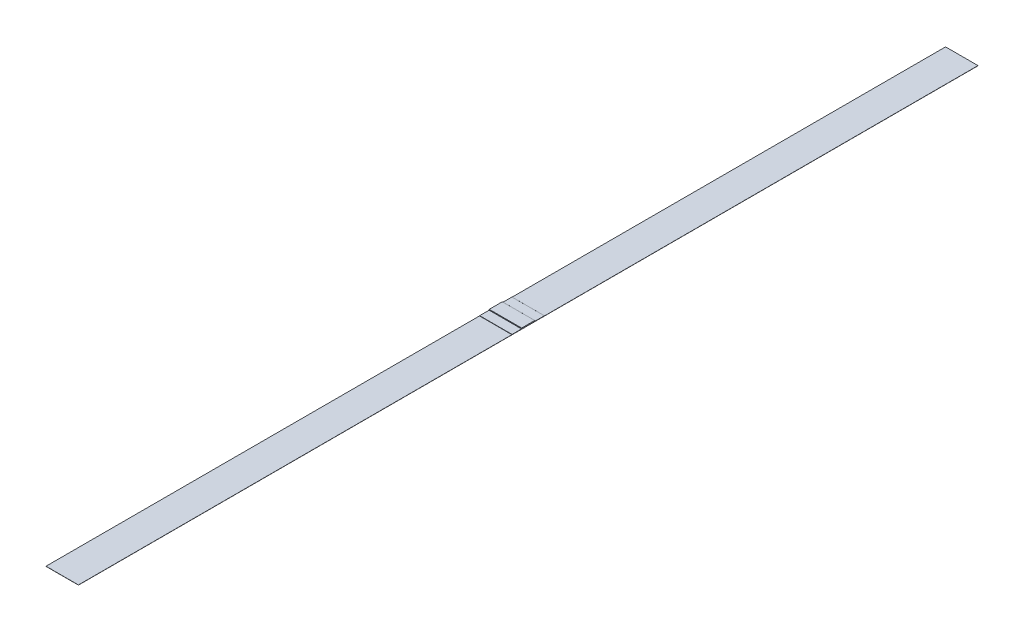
ISO-10303-21;
HEADER;
FILE_DESCRIPTION(('STEP AP214'),'2;1');
FILE_NAME('part.step','',(''),(''),'','','');
FILE_SCHEMA(('AUTOMOTIVE_DESIGN { 1 0 10303 214 1 1 1 1 }'));
ENDSEC;
DATA;
#1=APPLICATION_CONTEXT('core data for automotive mechanical design processes');
#2=APPLICATION_PROTOCOL_DEFINITION('international standard','automotive_design',2000,#1);
#3=PRODUCT_CONTEXT('',#1,'mechanical');
#4=PRODUCT('Part','Part','',(#3));
#5=PRODUCT_RELATED_PRODUCT_CATEGORY('part','',(#4));
#6=PRODUCT_DEFINITION_FORMATION('','',#4);
#7=PRODUCT_DEFINITION_CONTEXT('part definition',#1,'design');
#8=PRODUCT_DEFINITION('design','',#6,#7);
#9=PRODUCT_DEFINITION_SHAPE('','',#8);
#10=(LENGTH_UNIT() NAMED_UNIT(*) SI_UNIT(.MILLI.,.METRE.));
#11=(NAMED_UNIT(*) PLANE_ANGLE_UNIT() SI_UNIT($,.RADIAN.));
#12=(NAMED_UNIT(*) SI_UNIT($,.STERADIAN.) SOLID_ANGLE_UNIT());
#13=UNCERTAINTY_MEASURE_WITH_UNIT(LENGTH_MEASURE(1.E-05),#10,'distance_accuracy_value','');
#14=(GEOMETRIC_REPRESENTATION_CONTEXT(3) GLOBAL_UNCERTAINTY_ASSIGNED_CONTEXT((#13)) GLOBAL_UNIT_ASSIGNED_CONTEXT((#10,
#11,#12)) REPRESENTATION_CONTEXT('',''));
#15=CARTESIAN_POINT('',(0.,0.,0.));
#16=DIRECTION('',(0.,0.,1.));
#17=DIRECTION('',(1.,0.,0.));
#18=AXIS2_PLACEMENT_3D('',#15,#16,#17);
#19=CARTESIAN_POINT('',(0.,0.508,0.));
#20=DIRECTION('',(0.,1.,0.));
#21=DIRECTION('',(0.,0.,1.));
#22=AXIS2_PLACEMENT_3D('',#19,#20,#21);
#23=PLANE('',#22);
#24=DIRECTION('',(0.,0.,-1.));
#25=VECTOR('',#24,1.);
#26=CARTESIAN_POINT('',(66.675,0.508,0.));
#27=LINE('',#26,#25);
#28=CARTESIAN_POINT('',(66.675,0.508,-560.5145));
#29=VERTEX_POINT('',#28);
#30=CARTESIAN_POINT('',(66.675,0.508,-574.3575));
#31=VERTEX_POINT('',#30);
#32=EDGE_CURVE('E287',#29,#31,#27,.T.);
#33=ORIENTED_EDGE('',*,*,#32,.T.);
#34=DIRECTION('',(1.,0.,0.));
#35=VECTOR('',#34,1.);
#36=CARTESIAN_POINT('',(0.,0.508,-574.3575));
#37=LINE('',#36,#35);
#38=CARTESIAN_POINT('',(19.05,0.508,-574.3575));
#39=VERTEX_POINT('',#38);
#40=EDGE_CURVE('E253',#31,#39,#37,.F.);
#41=ORIENTED_EDGE('',*,*,#40,.T.);
#42=DIRECTION('',(0.,0.,1.));
#43=VECTOR('',#42,1.);
#44=CARTESIAN_POINT('',(19.05,0.508,0.));
#45=LINE('',#44,#43);
#46=CARTESIAN_POINT('',(19.05,0.508,-560.5145));
#47=VERTEX_POINT('',#46);
#48=EDGE_CURVE('E224',#39,#47,#45,.T.);
#49=ORIENTED_EDGE('',*,*,#48,.T.);
#50=DIRECTION('',(1.,0.,0.));
#51=VECTOR('',#50,1.);
#52=CARTESIAN_POINT('',(66.675,0.508,-560.5145));
#53=LINE('',#52,#51);
#54=EDGE_CURVE('E201',#47,#29,#53,.T.);
#55=ORIENTED_EDGE('',*,*,#54,.T.);
#56=EDGE_LOOP('',(#33,#41,#49,#55));
#57=FACE_BOUND('',#56,.T.);
#58=ADVANCED_FACE('F37',(#57),#23,.T.);
#59=CARTESIAN_POINT('',(19.05,0.508,-607.8855));
#60=VERTEX_POINT('',#59);
#61=CARTESIAN_POINT('',(19.05,0.508,-594.0425));
#62=VERTEX_POINT('',#61);
#63=EDGE_CURVE('E281',#60,#62,#45,.T.);
#64=ORIENTED_EDGE('',*,*,#63,.T.);
#65=DIRECTION('',(-1.,0.,0.));
#66=VECTOR('',#65,1.);
#67=CARTESIAN_POINT('',(0.,0.508,-594.0425));
#68=LINE('',#67,#66);
#69=CARTESIAN_POINT('',(66.675,0.508,-594.0425));
#70=VERTEX_POINT('',#69);
#71=EDGE_CURVE('E233',#62,#70,#68,.F.);
#72=ORIENTED_EDGE('',*,*,#71,.T.);
#73=CARTESIAN_POINT('',(66.675,0.508,-607.8855));
#74=VERTEX_POINT('',#73);
#75=EDGE_CURVE('E263',#70,#74,#27,.T.);
#76=ORIENTED_EDGE('',*,*,#75,.T.);
#77=DIRECTION('',(1.,0.,0.));
#78=VECTOR('',#77,1.);
#79=CARTESIAN_POINT('',(0.,0.508,-607.8855));
#80=LINE('',#79,#78);
#81=EDGE_CURVE('E204',#74,#60,#80,.F.);
#82=ORIENTED_EDGE('',*,*,#81,.T.);
#83=EDGE_LOOP('',(#64,#72,#76,#82));
#84=FACE_BOUND('',#83,.T.);
#85=ADVANCED_FACE('F284',(#84),#23,.T.);
#86=CARTESIAN_POINT('',(0.,0.254,0.));
#87=DIRECTION('',(0.,1.,0.));
#88=DIRECTION('',(0.,0.,1.));
#89=AXIS2_PLACEMENT_3D('',#86,#87,#88);
#90=PLANE('',#89);
#91=DIRECTION('',(0.,0.,-1.));
#92=VECTOR('',#91,1.);
#93=CARTESIAN_POINT('',(19.05,0.254,0.));
#94=LINE('',#93,#92);
#95=CARTESIAN_POINT('',(19.05,0.254,-608.1395));
#96=VERTEX_POINT('',#95);
#97=CARTESIAN_POINT('',(19.05,0.254,-1244.6));
#98=VERTEX_POINT('',#97);
#99=EDGE_CURVE('E294',#96,#98,#94,.T.);
#100=ORIENTED_EDGE('',*,*,#99,.F.);
#101=DIRECTION('',(1.,0.,0.));
#102=VECTOR('',#101,1.);
#103=CARTESIAN_POINT('',(66.675,0.254,-608.1395));
#104=LINE('',#103,#102);
#105=CARTESIAN_POINT('',(66.675,0.254,-608.1395));
#106=VERTEX_POINT('',#105);
#107=EDGE_CURVE('E187',#96,#106,#104,.T.);
#108=ORIENTED_EDGE('',*,*,#107,.T.);
#109=DIRECTION('',(0.,0.,-1.));
#110=VECTOR('',#109,1.);
#111=CARTESIAN_POINT('',(66.675,0.254,0.));
#112=LINE('',#111,#110);
#113=CARTESIAN_POINT('',(66.675,0.254,-1244.6));
#114=VERTEX_POINT('',#113);
#115=EDGE_CURVE('E173',#106,#114,#112,.T.);
#116=ORIENTED_EDGE('',*,*,#115,.T.);
#117=DIRECTION('',(1.,0.,0.));
#118=VECTOR('',#117,1.);
#119=CARTESIAN_POINT('',(0.,0.254,-1244.6));
#120=LINE('',#119,#118);
#121=EDGE_CURVE('E172',#98,#114,#120,.T.);
#122=ORIENTED_EDGE('',*,*,#121,.F.);
#123=EDGE_LOOP('',(#100,#108,#116,#122));
#124=FACE_BOUND('',#123,.T.);
#125=ADVANCED_FACE('F317',(#124),#90,.T.);
#126=CARTESIAN_POINT('',(0.,0.254,76.2));
#127=DIRECTION('',(0.,0.,-1.));
#128=DIRECTION('',(-1.,0.,0.));
#129=AXIS2_PLACEMENT_3D('',#126,#127,#128);
#130=PLANE('',#129);
#131=DIRECTION('',(1.,0.,0.));
#132=VECTOR('',#131,1.);
#133=CARTESIAN_POINT('',(0.,0.,76.2));
#134=LINE('',#133,#132);
#135=CARTESIAN_POINT('',(19.05,0.,76.2));
#136=VERTEX_POINT('',#135);
#137=CARTESIAN_POINT('',(66.675,0.,76.2));
#138=VERTEX_POINT('',#137);
#139=EDGE_CURVE('E186',#136,#138,#134,.T.);
#140=ORIENTED_EDGE('',*,*,#139,.T.);
#141=DIRECTION('',(0.,-1.,0.));
#142=VECTOR('',#141,1.);
#143=CARTESIAN_POINT('',(66.675,0.254,76.2));
#144=LINE('',#143,#142);
#145=CARTESIAN_POINT('',(66.675,0.254,76.2));
#146=VERTEX_POINT('',#145);
#147=EDGE_CURVE('E166',#146,#138,#144,.T.);
#148=ORIENTED_EDGE('',*,*,#147,.F.);
#149=DIRECTION('',(1.,0.,0.));
#150=VECTOR('',#149,1.);
#151=CARTESIAN_POINT('',(0.,0.254,76.2));
#152=LINE('',#151,#150);
#153=CARTESIAN_POINT('',(19.05,0.254,76.2));
#154=VERTEX_POINT('',#153);
#155=EDGE_CURVE('E177',#154,#146,#152,.T.);
#156=ORIENTED_EDGE('',*,*,#155,.F.);
#157=DIRECTION('',(0.,-1.,0.));
#158=VECTOR('',#157,1.);
#159=CARTESIAN_POINT('',(19.05,0.254,76.2));
#160=LINE('',#159,#158);
#161=EDGE_CURVE('E296',#154,#136,#160,.T.);
#162=ORIENTED_EDGE('',*,*,#161,.T.);
#163=EDGE_LOOP('',(#140,#148,#156,#162));
#164=FACE_BOUND('',#163,.T.);
#165=ADVANCED_FACE('F184',(#164),#130,.F.);
#166=CARTESIAN_POINT('',(66.675,0.254,0.));
#167=DIRECTION('',(-1.,0.,0.));
#168=DIRECTION('',(0.,0.,1.));
#169=AXIS2_PLACEMENT_3D('',#166,#167,#168);
#170=PLANE('',#169);
#171=DIRECTION('',(0.,-1.,0.));
#172=VECTOR('',#171,1.);
#173=CARTESIAN_POINT('',(66.675,1.524,-593.9155));
#174=LINE('',#173,#172);
#175=CARTESIAN_POINT('',(66.675,1.397,-593.9155));
#176=VERTEX_POINT('',#175);
#177=CARTESIAN_POINT('',(66.675,0.635,-593.9155));
#178=VERTEX_POINT('',#177);
#179=EDGE_CURVE('E261',#176,#178,#174,.T.);
#180=ORIENTED_EDGE('',*,*,#179,.F.);
#181=CARTESIAN_POINT('',(66.675,1.397,-593.7885));
#182=DIRECTION('',(-1.,0.,0.));
#183=DIRECTION('',(0.,0.,1.));
#184=AXIS2_PLACEMENT_3D('',#181,#182,#183);
#185=CIRCLE('',#184,0.127);
#186=CARTESIAN_POINT('',(66.675,1.524,-593.7885));
#187=VERTEX_POINT('',#186);
#188=EDGE_CURVE('E247',#176,#187,#185,.F.);
#189=ORIENTED_EDGE('',*,*,#188,.T.);
#190=DIRECTION('',(0.,0.,-1.));
#191=VECTOR('',#190,1.);
#192=CARTESIAN_POINT('',(66.675,1.524,-574.4845));
#193=LINE('',#192,#191);
#194=CARTESIAN_POINT('',(66.675,1.524,-574.6115));
#195=VERTEX_POINT('',#194);
#196=EDGE_CURVE('E458',#195,#187,#193,.T.);
#197=ORIENTED_EDGE('',*,*,#196,.F.);
#198=CARTESIAN_POINT('',(66.675,1.397,-574.6115));
#199=DIRECTION('',(-1.,0.,0.));
#200=DIRECTION('',(0.,0.,1.));
#201=AXIS2_PLACEMENT_3D('',#198,#199,#200);
#202=CIRCLE('',#201,0.127);
#203=CARTESIAN_POINT('',(66.675,1.397,-574.4845));
#204=VERTEX_POINT('',#203);
#205=EDGE_CURVE('E245',#195,#204,#202,.F.);
#206=ORIENTED_EDGE('',*,*,#205,.T.);
#207=DIRECTION('',(0.,-1.,0.));
#208=VECTOR('',#207,1.);
#209=CARTESIAN_POINT('',(66.675,1.524,-574.4845));
#210=LINE('',#209,#208);
#211=CARTESIAN_POINT('',(66.675,0.635,-574.4845));
#212=VERTEX_POINT('',#211);
#213=EDGE_CURVE('E272',#204,#212,#210,.T.);
#214=ORIENTED_EDGE('',*,*,#213,.T.);
#215=CARTESIAN_POINT('',(66.675,0.635,-574.3575));
#216=DIRECTION('',(-1.,0.,0.));
#217=DIRECTION('',(0.,0.,1.));
#218=AXIS2_PLACEMENT_3D('',#215,#216,#217);
#219=CIRCLE('',#218,0.127);
#220=EDGE_CURVE('E45',#212,#31,#219,.T.);
#221=ORIENTED_EDGE('',*,*,#220,.T.);
#222=ORIENTED_EDGE('',*,*,#32,.F.);
#223=CARTESIAN_POINT('',(66.675,0.381,-560.5145));
#224=DIRECTION('',(-1.,0.,0.));
#225=DIRECTION('',(0.,0.,1.));
#226=AXIS2_PLACEMENT_3D('',#223,#224,#225);
#227=CIRCLE('',#226,0.127);
#228=CARTESIAN_POINT('',(66.675,0.381,-560.3875));
#229=VERTEX_POINT('',#228);
#230=EDGE_CURVE('E191',#29,#229,#227,.F.);
#231=ORIENTED_EDGE('',*,*,#230,.T.);
#232=CARTESIAN_POINT('',(66.675,0.381,-560.2605));
#233=DIRECTION('',(-1.,0.,0.));
#234=DIRECTION('',(0.,0.,1.));
#235=AXIS2_PLACEMENT_3D('',#232,#233,#234);
#236=CIRCLE('',#235,0.127);
#237=CARTESIAN_POINT('',(66.675,0.254,-560.2605));
#238=VERTEX_POINT('',#237);
#239=EDGE_CURVE('E169',#229,#238,#236,.T.);
#240=ORIENTED_EDGE('',*,*,#239,.T.);
#241=EDGE_CURVE('E160',#146,#238,#112,.T.);
#242=ORIENTED_EDGE('',*,*,#241,.F.);
#243=ORIENTED_EDGE('',*,*,#147,.T.);
#244=DIRECTION('',(0.,0.,-1.));
#245=VECTOR('',#244,1.);
#246=CARTESIAN_POINT('',(66.675,0.,0.));
#247=LINE('',#246,#245);
#248=CARTESIAN_POINT('',(66.675,0.,-1244.6));
#249=VERTEX_POINT('',#248);
#250=EDGE_CURVE('E298',#138,#249,#247,.T.);
#251=ORIENTED_EDGE('',*,*,#250,.T.);
#252=DIRECTION('',(0.,-1.,0.));
#253=VECTOR('',#252,1.);
#254=CARTESIAN_POINT('',(66.675,0.254,-1244.6));
#255=LINE('',#254,#253);
#256=EDGE_CURVE('E188',#114,#249,#255,.T.);
#257=ORIENTED_EDGE('',*,*,#256,.F.);
#258=ORIENTED_EDGE('',*,*,#115,.F.);
#259=CARTESIAN_POINT('',(66.675,0.381,-608.1395));
#260=DIRECTION('',(-1.,0.,0.));
#261=DIRECTION('',(0.,0.,1.));
#262=AXIS2_PLACEMENT_3D('',#259,#260,#261);
#263=CIRCLE('',#262,0.127);
#264=CARTESIAN_POINT('',(66.675,0.381,-608.0125));
#265=VERTEX_POINT('',#264);
#266=EDGE_CURVE('E213',#106,#265,#263,.T.);
#267=ORIENTED_EDGE('',*,*,#266,.T.);
#268=CARTESIAN_POINT('',(66.675,0.381,-607.8855));
#269=DIRECTION('',(-1.,0.,0.));
#270=DIRECTION('',(0.,0.,1.));
#271=AXIS2_PLACEMENT_3D('',#268,#269,#270);
#272=CIRCLE('',#271,0.127);
#273=EDGE_CURVE('E198',#265,#74,#272,.F.);
#274=ORIENTED_EDGE('',*,*,#273,.T.);
#275=ORIENTED_EDGE('',*,*,#75,.F.);
#276=CARTESIAN_POINT('',(66.675,0.635,-594.0425));
#277=DIRECTION('',(-1.,0.,0.));
#278=DIRECTION('',(0.,0.,1.));
#279=AXIS2_PLACEMENT_3D('',#276,#277,#278);
#280=CIRCLE('',#279,0.127);
#281=EDGE_CURVE('E257',#70,#178,#280,.T.);
#282=ORIENTED_EDGE('',*,*,#281,.T.);
#283=EDGE_LOOP('',(#180,#189,#197,#206,#214,#221,#222,#231,#240,#242,#243,#251,#257,#258,#267,
#274,#275,#282));
#284=FACE_BOUND('',#283,.T.);
#285=ADVANCED_FACE('F163',(#284),#170,.F.);
#286=CARTESIAN_POINT('',(0.,0.254,-1244.6));
#287=DIRECTION('',(0.,0.,-1.));
#288=DIRECTION('',(-1.,0.,0.));
#289=AXIS2_PLACEMENT_3D('',#286,#287,#288);
#290=PLANE('',#289);
#291=DIRECTION('',(1.,0.,0.));
#292=VECTOR('',#291,1.);
#293=CARTESIAN_POINT('',(0.,0.,-1244.6));
#294=LINE('',#293,#292);
#295=CARTESIAN_POINT('',(19.05,0.,-1244.6));
#296=VERTEX_POINT('',#295);
#297=EDGE_CURVE('E300',#296,#249,#294,.T.);
#298=ORIENTED_EDGE('',*,*,#297,.F.);
#299=DIRECTION('',(0.,-1.,0.));
#300=VECTOR('',#299,1.);
#301=CARTESIAN_POINT('',(19.05,0.254,-1244.6));
#302=LINE('',#301,#300);
#303=EDGE_CURVE('E193',#98,#296,#302,.T.);
#304=ORIENTED_EDGE('',*,*,#303,.F.);
#305=ORIENTED_EDGE('',*,*,#121,.T.);
#306=ORIENTED_EDGE('',*,*,#256,.T.);
#307=EDGE_LOOP('',(#298,#304,#305,#306));
#308=FACE_BOUND('',#307,.T.);
#309=ADVANCED_FACE('F311',(#308),#290,.T.);
#310=CARTESIAN_POINT('',(19.05,0.254,0.));
#311=DIRECTION('',(-1.,0.,0.));
#312=DIRECTION('',(0.,0.,1.));
#313=AXIS2_PLACEMENT_3D('',#310,#311,#312);
#314=PLANE('',#313);
#315=DIRECTION('',(0.,0.,1.));
#316=VECTOR('',#315,1.);
#317=CARTESIAN_POINT('',(19.05,1.524,-574.4845));
#318=LINE('',#317,#316);
#319=CARTESIAN_POINT('',(19.05,1.524,-593.7885));
#320=VERTEX_POINT('',#319);
#321=CARTESIAN_POINT('',(19.05,1.524,-574.6115));
#322=VERTEX_POINT('',#321);
#323=EDGE_CURVE('E461',#320,#322,#318,.T.);
#324=ORIENTED_EDGE('',*,*,#323,.F.);
#325=CARTESIAN_POINT('',(19.05,1.397,-593.7885));
#326=DIRECTION('',(-1.,0.,0.));
#327=DIRECTION('',(0.,0.,1.));
#328=AXIS2_PLACEMENT_3D('',#325,#326,#327);
#329=CIRCLE('',#328,0.127);
#330=CARTESIAN_POINT('',(19.05,1.397,-593.9155));
#331=VERTEX_POINT('',#330);
#332=EDGE_CURVE('E243',#320,#331,#329,.T.);
#333=ORIENTED_EDGE('',*,*,#332,.T.);
#334=DIRECTION('',(0.,-1.,0.));
#335=VECTOR('',#334,1.);
#336=CARTESIAN_POINT('',(19.05,1.524,-593.9155));
#337=LINE('',#336,#335);
#338=CARTESIAN_POINT('',(19.05,0.635,-593.9155));
#339=VERTEX_POINT('',#338);
#340=EDGE_CURVE('E273',#331,#339,#337,.T.);
#341=ORIENTED_EDGE('',*,*,#340,.T.);
#342=CARTESIAN_POINT('',(19.05,0.635,-594.0425));
#343=DIRECTION('',(-1.,0.,0.));
#344=DIRECTION('',(0.,0.,1.));
#345=AXIS2_PLACEMENT_3D('',#342,#343,#344);
#346=CIRCLE('',#345,0.127);
#347=EDGE_CURVE('E255',#339,#62,#346,.F.);
#348=ORIENTED_EDGE('',*,*,#347,.T.);
#349=ORIENTED_EDGE('',*,*,#63,.F.);
#350=CARTESIAN_POINT('',(19.05,0.381,-607.8855));
#351=DIRECTION('',(-1.,0.,0.));
#352=DIRECTION('',(0.,0.,1.));
#353=AXIS2_PLACEMENT_3D('',#350,#351,#352);
#354=CIRCLE('',#353,0.127);
#355=CARTESIAN_POINT('',(19.05,0.381,-608.0125));
#356=VERTEX_POINT('',#355);
#357=EDGE_CURVE('E209',#60,#356,#354,.T.);
#358=ORIENTED_EDGE('',*,*,#357,.T.);
#359=CARTESIAN_POINT('',(19.05,0.381,-608.1395));
#360=DIRECTION('',(-1.,0.,0.));
#361=DIRECTION('',(0.,0.,1.));
#362=AXIS2_PLACEMENT_3D('',#359,#360,#361);
#363=CIRCLE('',#362,0.127);
#364=EDGE_CURVE('E215',#356,#96,#363,.F.);
#365=ORIENTED_EDGE('',*,*,#364,.T.);
#366=ORIENTED_EDGE('',*,*,#99,.T.);
#367=ORIENTED_EDGE('',*,*,#303,.T.);
#368=DIRECTION('',(0.,0.,-1.));
#369=VECTOR('',#368,1.);
#370=CARTESIAN_POINT('',(19.05,0.,0.));
#371=LINE('',#370,#369);
#372=EDGE_CURVE('E182',#136,#296,#371,.T.);
#373=ORIENTED_EDGE('',*,*,#372,.F.);
#374=ORIENTED_EDGE('',*,*,#161,.F.);
#375=CARTESIAN_POINT('',(19.05,0.254,-560.2605));
#376=VERTEX_POINT('',#375);
#377=EDGE_CURVE('E180',#154,#376,#94,.T.);
#378=ORIENTED_EDGE('',*,*,#377,.T.);
#379=CARTESIAN_POINT('',(19.05,0.381,-560.2605));
#380=DIRECTION('',(-1.,0.,0.));
#381=DIRECTION('',(0.,0.,1.));
#382=AXIS2_PLACEMENT_3D('',#379,#380,#381);
#383=CIRCLE('',#382,0.127);
#384=CARTESIAN_POINT('',(19.05,0.381,-560.3875));
#385=VERTEX_POINT('',#384);
#386=EDGE_CURVE('E218',#376,#385,#383,.F.);
#387=ORIENTED_EDGE('',*,*,#386,.T.);
#388=CARTESIAN_POINT('',(19.05,0.381,-560.5145));
#389=DIRECTION('',(-1.,0.,0.));
#390=DIRECTION('',(0.,0.,1.));
#391=AXIS2_PLACEMENT_3D('',#388,#389,#390);
#392=CIRCLE('',#391,0.127);
#393=EDGE_CURVE('E206',#385,#47,#392,.T.);
#394=ORIENTED_EDGE('',*,*,#393,.T.);
#395=ORIENTED_EDGE('',*,*,#48,.F.);
#396=CARTESIAN_POINT('',(19.05,0.635,-574.3575));
#397=DIRECTION('',(-1.,0.,0.));
#398=DIRECTION('',(0.,0.,1.));
#399=AXIS2_PLACEMENT_3D('',#396,#397,#398);
#400=CIRCLE('',#399,0.127);
#401=CARTESIAN_POINT('',(19.05,0.635,-574.4845));
#402=VERTEX_POINT('',#401);
#403=EDGE_CURVE('E11',#39,#402,#400,.F.);
#404=ORIENTED_EDGE('',*,*,#403,.T.);
#405=DIRECTION('',(0.,-1.,0.));
#406=VECTOR('',#405,1.);
#407=CARTESIAN_POINT('',(19.05,1.524,-574.4845));
#408=LINE('',#407,#406);
#409=CARTESIAN_POINT('',(19.05,1.397,-574.4845));
#410=VERTEX_POINT('',#409);
#411=EDGE_CURVE('E228',#410,#402,#408,.T.);
#412=ORIENTED_EDGE('',*,*,#411,.F.);
#413=CARTESIAN_POINT('',(19.05,1.397,-574.6115));
#414=DIRECTION('',(-1.,0.,0.));
#415=DIRECTION('',(0.,0.,1.));
#416=AXIS2_PLACEMENT_3D('',#413,#414,#415);
#417=CIRCLE('',#416,0.127);
#418=EDGE_CURVE('E241',#410,#322,#417,.T.);
#419=ORIENTED_EDGE('',*,*,#418,.T.);
#420=EDGE_LOOP('',(#324,#333,#341,#348,#349,#358,#365,#366,#367,#373,#374,#378,#387,#394,#395,
#404,#412,#419));
#421=FACE_BOUND('',#420,.T.);
#422=ADVANCED_FACE('F280',(#421),#314,.T.);
#423=ORIENTED_EDGE('',*,*,#241,.T.);
#424=DIRECTION('',(1.,0.,0.));
#425=VECTOR('',#424,1.);
#426=CARTESIAN_POINT('',(0.,0.254,-560.2605));
#427=LINE('',#426,#425);
#428=EDGE_CURVE('E211',#238,#376,#427,.F.);
#429=ORIENTED_EDGE('',*,*,#428,.T.);
#430=ORIENTED_EDGE('',*,*,#377,.F.);
#431=ORIENTED_EDGE('',*,*,#155,.T.);
#432=EDGE_LOOP('',(#423,#429,#430,#431));
#433=FACE_BOUND('',#432,.T.);
#434=ADVANCED_FACE('F178',(#433),#90,.T.);
#435=CARTESIAN_POINT('',(0.,0.,0.));
#436=DIRECTION('',(0.,1.,0.));
#437=DIRECTION('',(0.,0.,1.));
#438=AXIS2_PLACEMENT_3D('',#435,#436,#437);
#439=PLANE('',#438);
#440=ORIENTED_EDGE('',*,*,#139,.F.);
#441=ORIENTED_EDGE('',*,*,#372,.T.);
#442=ORIENTED_EDGE('',*,*,#297,.T.);
#443=ORIENTED_EDGE('',*,*,#250,.F.);
#444=EDGE_LOOP('',(#440,#441,#442,#443));
#445=FACE_BOUND('',#444,.T.);
#446=ADVANCED_FACE('F314',(#445),#439,.F.);
#447=CARTESIAN_POINT('',(0.,0.381,-607.8855));
#448=DIRECTION('',(1.,0.,0.));
#449=DIRECTION('',(0.,0.,-1.));
#450=AXIS2_PLACEMENT_3D('',#447,#448,#449);
#451=CYLINDRICAL_SURFACE('',#450,0.127);
#452=DIRECTION('',(1.,0.,0.));
#453=VECTOR('',#452,1.);
#454=CARTESIAN_POINT('',(0.,0.381,-608.0125));
#455=LINE('',#454,#453);
#456=EDGE_CURVE('E221',#356,#265,#455,.T.);
#457=ORIENTED_EDGE('',*,*,#456,.F.);
#458=ORIENTED_EDGE('',*,*,#357,.F.);
#459=ORIENTED_EDGE('',*,*,#81,.F.);
#460=ORIENTED_EDGE('',*,*,#273,.F.);
#461=EDGE_LOOP('',(#457,#458,#459,#460));
#462=FACE_BOUND('',#461,.T.);
#463=ADVANCED_FACE('F325',(#462),#451,.T.);
#464=CARTESIAN_POINT('',(0.,0.381,-608.1395));
#465=DIRECTION('',(-1.,0.,0.));
#466=DIRECTION('',(0.,0.,1.));
#467=AXIS2_PLACEMENT_3D('',#464,#465,#466);
#468=CYLINDRICAL_SURFACE('',#467,0.127);
#469=ORIENTED_EDGE('',*,*,#364,.F.);
#470=ORIENTED_EDGE('',*,*,#456,.T.);
#471=ORIENTED_EDGE('',*,*,#266,.F.);
#472=ORIENTED_EDGE('',*,*,#107,.F.);
#473=EDGE_LOOP('',(#469,#470,#471,#472));
#474=FACE_BOUND('',#473,.T.);
#475=ADVANCED_FACE('F321',(#474),#468,.F.);
#476=CARTESIAN_POINT('',(0.,0.381,-560.2605));
#477=DIRECTION('',(1.,0.,0.));
#478=DIRECTION('',(0.,0.,-1.));
#479=AXIS2_PLACEMENT_3D('',#476,#477,#478);
#480=CYLINDRICAL_SURFACE('',#479,0.127);
#481=DIRECTION('',(1.,0.,0.));
#482=VECTOR('',#481,1.);
#483=CARTESIAN_POINT('',(0.,0.381,-560.3875));
#484=LINE('',#483,#482);
#485=EDGE_CURVE('E225',#385,#229,#484,.T.);
#486=ORIENTED_EDGE('',*,*,#485,.F.);
#487=ORIENTED_EDGE('',*,*,#386,.F.);
#488=ORIENTED_EDGE('',*,*,#428,.F.);
#489=ORIENTED_EDGE('',*,*,#239,.F.);
#490=EDGE_LOOP('',(#486,#487,#488,#489));
#491=FACE_BOUND('',#490,.T.);
#492=ADVANCED_FACE('F332',(#491),#480,.F.);
#493=CARTESIAN_POINT('',(0.,0.381,-560.5145));
#494=DIRECTION('',(-1.,0.,0.));
#495=DIRECTION('',(0.,0.,1.));
#496=AXIS2_PLACEMENT_3D('',#493,#494,#495);
#497=CYLINDRICAL_SURFACE('',#496,0.127);
#498=ORIENTED_EDGE('',*,*,#393,.F.);
#499=ORIENTED_EDGE('',*,*,#485,.T.);
#500=ORIENTED_EDGE('',*,*,#230,.F.);
#501=ORIENTED_EDGE('',*,*,#54,.F.);
#502=EDGE_LOOP('',(#498,#499,#500,#501));
#503=FACE_BOUND('',#502,.T.);
#504=ADVANCED_FACE('F393',(#503),#497,.T.);
#505=CARTESIAN_POINT('',(19.05,1.524,-574.4845));
#506=DIRECTION('',(0.,0.,-1.));
#507=DIRECTION('',(-1.,0.,0.));
#508=AXIS2_PLACEMENT_3D('',#505,#506,#507);
#509=PLANE('',#508);
#510=ORIENTED_EDGE('',*,*,#213,.F.);
#511=DIRECTION('',(1.,0.,0.));
#512=VECTOR('',#511,1.);
#513=CARTESIAN_POINT('',(19.05,1.397,-574.4845));
#514=LINE('',#513,#512);
#515=EDGE_CURVE('E251',#204,#410,#514,.F.);
#516=ORIENTED_EDGE('',*,*,#515,.T.);
#517=ORIENTED_EDGE('',*,*,#411,.T.);
#518=DIRECTION('',(1.,0.,0.));
#519=VECTOR('',#518,1.);
#520=CARTESIAN_POINT('',(19.05,0.635,-574.4845));
#521=LINE('',#520,#519);
#522=EDGE_CURVE('E249',#402,#212,#521,.T.);
#523=ORIENTED_EDGE('',*,*,#522,.T.);
#524=EDGE_LOOP('',(#510,#516,#517,#523));
#525=FACE_BOUND('',#524,.T.);
#526=ADVANCED_FACE('F344',(#525),#509,.F.);
#527=CARTESIAN_POINT('',(19.05,1.524,-593.9155));
#528=DIRECTION('',(0.,0.,1.));
#529=DIRECTION('',(1.,0.,0.));
#530=AXIS2_PLACEMENT_3D('',#527,#528,#529);
#531=PLANE('',#530);
#532=ORIENTED_EDGE('',*,*,#179,.T.);
#533=DIRECTION('',(-1.,0.,0.));
#534=VECTOR('',#533,1.);
#535=CARTESIAN_POINT('',(19.05,0.635,-593.9155));
#536=LINE('',#535,#534);
#537=EDGE_CURVE('E230',#178,#339,#536,.T.);
#538=ORIENTED_EDGE('',*,*,#537,.T.);
#539=ORIENTED_EDGE('',*,*,#340,.F.);
#540=DIRECTION('',(-1.,0.,0.));
#541=VECTOR('',#540,1.);
#542=CARTESIAN_POINT('',(19.05,1.397,-593.9155));
#543=LINE('',#542,#541);
#544=EDGE_CURVE('E220',#331,#176,#543,.F.);
#545=ORIENTED_EDGE('',*,*,#544,.T.);
#546=EDGE_LOOP('',(#532,#538,#539,#545));
#547=FACE_BOUND('',#546,.T.);
#548=ADVANCED_FACE('F268',(#547),#531,.F.);
#549=CARTESIAN_POINT('',(0.,1.524,0.));
#550=DIRECTION('',(0.,-1.,0.));
#551=DIRECTION('',(0.,0.,-1.));
#552=AXIS2_PLACEMENT_3D('',#549,#550,#551);
#553=PLANE('',#552);
#554=ORIENTED_EDGE('',*,*,#196,.T.);
#555=DIRECTION('',(-1.,0.,0.));
#556=VECTOR('',#555,1.);
#557=CARTESIAN_POINT('',(0.,1.524,-593.7885));
#558=LINE('',#557,#556);
#559=EDGE_CURVE('E238',#187,#320,#558,.T.);
#560=ORIENTED_EDGE('',*,*,#559,.T.);
#561=ORIENTED_EDGE('',*,*,#323,.T.);
#562=DIRECTION('',(1.,0.,0.));
#563=VECTOR('',#562,1.);
#564=CARTESIAN_POINT('',(0.,1.524,-574.6115));
#565=LINE('',#564,#563);
#566=EDGE_CURVE('E235',#322,#195,#565,.T.);
#567=ORIENTED_EDGE('',*,*,#566,.T.);
#568=EDGE_LOOP('',(#554,#560,#561,#567));
#569=FACE_BOUND('',#568,.T.);
#570=ADVANCED_FACE('F403',(#569),#553,.F.);
#571=CARTESIAN_POINT('',(19.05,0.635,-594.0425));
#572=DIRECTION('',(-1.,0.,0.));
#573=DIRECTION('',(0.,0.,1.));
#574=AXIS2_PLACEMENT_3D('',#571,#572,#573);
#575=CYLINDRICAL_SURFACE('',#574,0.127);
#576=ORIENTED_EDGE('',*,*,#281,.F.);
#577=ORIENTED_EDGE('',*,*,#71,.F.);
#578=ORIENTED_EDGE('',*,*,#347,.F.);
#579=ORIENTED_EDGE('',*,*,#537,.F.);
#580=EDGE_LOOP('',(#576,#577,#578,#579));
#581=FACE_BOUND('',#580,.T.);
#582=ADVANCED_FACE('F275',(#581),#575,.F.);
#583=CARTESIAN_POINT('',(0.,1.397,-593.7885));
#584=DIRECTION('',(-1.,0.,0.));
#585=DIRECTION('',(0.,0.,1.));
#586=AXIS2_PLACEMENT_3D('',#583,#584,#585);
#587=CYLINDRICAL_SURFACE('',#586,0.127);
#588=ORIENTED_EDGE('',*,*,#188,.F.);
#589=ORIENTED_EDGE('',*,*,#544,.F.);
#590=ORIENTED_EDGE('',*,*,#332,.F.);
#591=ORIENTED_EDGE('',*,*,#559,.F.);
#592=EDGE_LOOP('',(#588,#589,#590,#591));
#593=FACE_BOUND('',#592,.T.);
#594=ADVANCED_FACE('F420',(#593),#587,.T.);
#595=CARTESIAN_POINT('',(0.,1.397,-574.6115));
#596=DIRECTION('',(1.,0.,0.));
#597=DIRECTION('',(0.,0.,-1.));
#598=AXIS2_PLACEMENT_3D('',#595,#596,#597);
#599=CYLINDRICAL_SURFACE('',#598,0.127);
#600=ORIENTED_EDGE('',*,*,#418,.F.);
#601=ORIENTED_EDGE('',*,*,#515,.F.);
#602=ORIENTED_EDGE('',*,*,#205,.F.);
#603=ORIENTED_EDGE('',*,*,#566,.F.);
#604=EDGE_LOOP('',(#600,#601,#602,#603));
#605=FACE_BOUND('',#604,.T.);
#606=ADVANCED_FACE('F429',(#605),#599,.T.);
#607=CARTESIAN_POINT('',(19.05,0.635,-574.3575));
#608=DIRECTION('',(1.,0.,0.));
#609=DIRECTION('',(0.,0.,-1.));
#610=AXIS2_PLACEMENT_3D('',#607,#608,#609);
#611=CYLINDRICAL_SURFACE('',#610,0.127);
#612=ORIENTED_EDGE('',*,*,#403,.F.);
#613=ORIENTED_EDGE('',*,*,#40,.F.);
#614=ORIENTED_EDGE('',*,*,#220,.F.);
#615=ORIENTED_EDGE('',*,*,#522,.F.);
#616=EDGE_LOOP('',(#612,#613,#614,#615));
#617=FACE_BOUND('',#616,.T.);
#618=ADVANCED_FACE('F39',(#617),#611,.F.);
#619=CLOSED_SHELL('',(#58,#85,#125,#165,#285,#309,#422,#434,#446,#463,#475,#492,#504,#526,#548,
#570,#582,#594,#606,#618));
#620=MANIFOLD_SOLID_BREP('B2',#619);
#621=ADVANCED_BREP_SHAPE_REPRESENTATION('',(#18,#620),#14);
#622=SHAPE_DEFINITION_REPRESENTATION(#9,#621);
ENDSEC;
END-ISO-10303-21;
